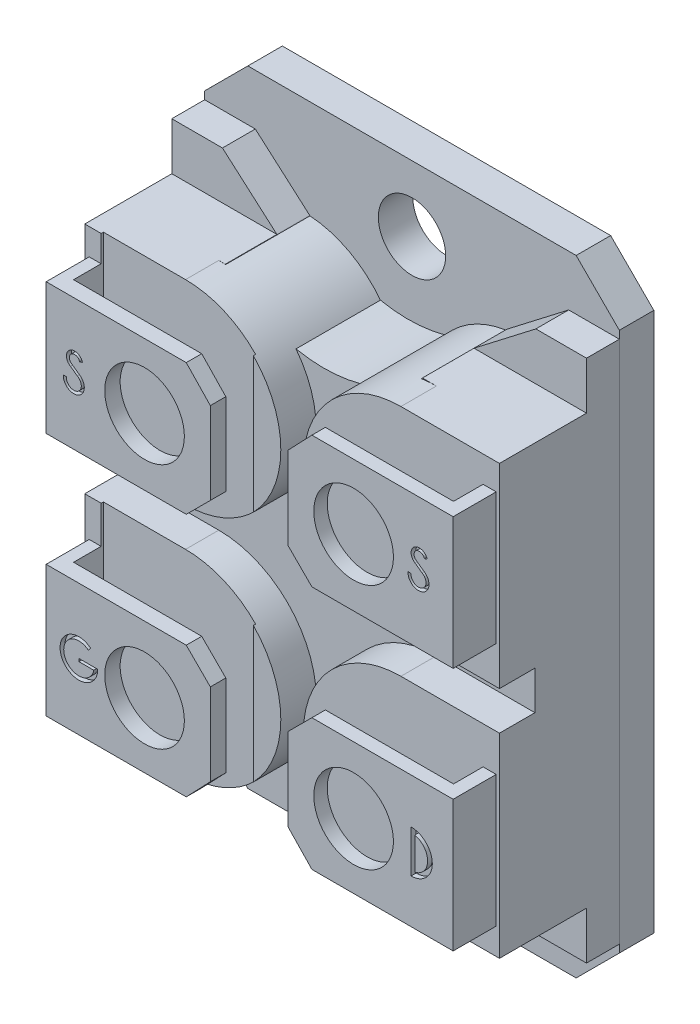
from build123d import *

# Parameters (mm, degrees)
SKETCH1_R           = 2.05
EXTRUDE1_DEPTH      = 2.1
EXTRUDE2_DEPTH      = 7.3
EXTRUDE3_DEPTH      = 5.14
CUT_EXTRUDE1_DEPTH  = 3.14
EXTRUDE4_DEPTH      = 2.62
SKETCH6_W           = 1.8
SKETCH6_H           = 22.9
CUT_EXTRUDE2_DEPTH  = 9.27
SKETCH7_W           = 4.822974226
SKETCH7_H           = 26.361157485
CUT_EXTRUDE4_DEPTH  = 0.2
SKETCH8_W           = 1.815156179
SKETCH8_H           = 27.911127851
CUT_EXTRUDE6_DEPTH  = 9.27
SKETCH9_W           = 2.62
SKETCH9_H           = 24.5
CUT_EXTRUDE7_DEPTH  = 0.27
SKETCH10_R          = 2.425
CUT_EXTRUDE8_DEPTH  = 1
CUT_EXTRUDE9_DEPTH  = 0.3
CUT_EXTRUDE10_DEPTH = 0.3
CUT_EXTRUDE11_DEPTH = 0.3
CUT_EXTRUDE12_DEPTH = 0.3
SKETCH16_W          = 2.1
SKETCH16_H          = 32.84
EXTRUDE5_DEPTH      = 0.0001
SKETCH17_W          = 2.1
SKETCH17_H          = 32.84
EXTRUDE6_DEPTH      = 0.0001


with BuildPart() as part:
    # Sketch1 → Extrude1 (new body)
    with BuildSketch(Plane.XY):
        with BuildLine():
            Line((2.63, 0), (10.575, 0))
            Line((10.575, 0), (10.575, 3.85))
            ThreePointArc((10.575, 3.85), (12.625, 5.9), (14.675, 3.85))
            Line((14.675, 3.85), (14.675, 0))
            Line((14.675, 0), (22.62, 0))
            Line((22.62, 0), (25.250000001, 2.63))
            Line((25.250000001, 2.63), (25.250000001, 35.47))
            Line((25.250000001, 35.47), (22.62, 38.1))
            Line((22.62, 38.1), (2.63, 38.1))
            Line((2.63, 38.1), (-1e-09, 35.47))
            Line((-1e-09, 35.47), (-1e-09, 2.63))
            Line((-1e-09, 2.63), (2.63, 0))
        make_face()
        with Locations((12.625, 34.1)):
            Circle(SKETCH1_R, mode=Mode.SUBTRACT)
    extrude(amount=EXTRUDE1_DEPTH)

    # Sketch2 → Extrude2 (add)
    with BuildSketch(Plane.XY.offset(2.1)):
        with BuildLine():
            Line((-1e-09, 32.1), (-1e-09, 20.225))
            Line((-1e-09, 20.225), (5.999999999, 20.225))
            ThreePointArc((5.999999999, 20.225), (11.937499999, 26.1625), (5.999999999, 32.1))
            Line((5.999999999, 32.1), (-1e-09, 32.1))
        make_face()
        with BuildLine():
            Line((-1e-09, 6), (5.999999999, 6))
            ThreePointArc((5.999999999, 6), (11.937499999, 11.9375), (5.999999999, 17.875))
            Line((5.999999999, 17.875), (-1e-09, 17.875))
            Line((-1e-09, 17.875), (-1e-09, 6))
        make_face()
        with BuildLine():
            Line((25.250000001, 32.1), (19.250000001, 32.1))
            ThreePointArc((19.250000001, 32.1), (13.312500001, 26.1625), (19.250000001, 20.225))
            Line((19.250000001, 20.225), (25.250000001, 20.225))
            Line((25.250000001, 20.225), (25.250000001, 32.1))
        make_face()
        with BuildLine():
            Line((25.250000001, 17.875), (19.250000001, 17.875))
            ThreePointArc((19.250000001, 17.875), (13.312500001, 11.9375), (19.250000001, 6))
            Line((19.250000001, 6), (25.250000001, 6))
            Line((25.250000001, 6), (25.250000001, 17.875))
        make_face()
    extrude(amount=EXTRUDE2_DEPTH)

    # Sketch3 → Extrude3 (add)
    with BuildSketch(Plane.XY.offset(2.1)):
        with BuildLine():
            Line((-1e-09, 35), (3.084073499, 35))
            Line((3.084073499, 35), (6.399999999, 32.1))
            ThreePointArc((6.399999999, 32.1), (12.399999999, 29.614718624), (18.399999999, 32.1))
            Line((18.399999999, 32.1), (22.165926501, 35))
            Line((22.165926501, 35), (25.250000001, 35))
            Line((25.250000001, 35), (25.250000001, 3.1))
            Line((25.250000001, 3.1), (22.165926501, 3.1))
            Line((22.165926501, 3.1), (18.399999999, 6))
            ThreePointArc((18.399999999, 6), (12.399999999, 8.485281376), (6.399999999, 6))
            Line((6.399999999, 6), (3.084073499, 3.1))
            Line((3.084073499, 3.1), (-1e-09, 3.1))
            Line((-1e-09, 3.1), (-1e-09, 35))
        make_face()
    extrude(amount=EXTRUDE3_DEPTH)

    # Sketch4 → Cut-Extrude1 (cut)
    with BuildSketch(Plane.XY.offset(7.24)):
        Polygon((-1e-09, 35), (25.249999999, 35), (25.249999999, 32.1), (0, 32.1), align=None)
        Polygon((25.249999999, 3.1), (25.249999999, 6), (0, 6), (-1e-09, 3.1), align=None)
    extrude(amount=-CUT_EXTRUDE1_DEPTH, mode=Mode.SUBTRACT)

    # Sketch5 → Extrude4 (add)
    with BuildSketch(Plane.XY.offset(9.4)):
        Polygon((-1e-09, 30.5), (8.799999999, 30.5), (10.266640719, 28.96664072), (10.266640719, 23.96664072), (8.799999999, 22.5), (-1e-09, 22.5), align=None)
        Polygon((-1e-09, 7.6), (-1e-09, 15.6), (8.799999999, 15.6), (10.266640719, 14.13335928), (10.266640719, 9.13335928), (8.799999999, 7.6), align=None)
        Polygon((14.983359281, 23.96664072), (16.450000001, 22.5), (25.250000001, 22.5), (25.250000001, 30.5), (16.450000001, 30.5), (14.983359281, 28.96664072), align=None)
        Polygon((14.983359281, 14.13335928), (16.450000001, 15.6), (25.250000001, 15.6), (25.250000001, 7.6), (16.450000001, 7.6), (14.983359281, 9.13335928), align=None)
    extrude(amount=EXTRUDE4_DEPTH)

    # Sketch6 → Cut-Extrude2 (cut)
    with BuildSketch(Plane.ZY.offset(-14.983359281)):
        with Locations((10.3, 19.05)):
            Rectangle(SKETCH6_W, SKETCH6_H)
    extrude(amount=-CUT_EXTRUDE2_DEPTH, mode=Mode.SUBTRACT)

    # Sketch7 → Cut-Extrude4 (cut)
    with BuildSketch(Plane(origin=(25.250000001, 0, 0), x_dir=(0, 0, -1), z_dir=(1, 0, 0))):
        with Locations((-11.811487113, 18.343266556)):
            Rectangle(SKETCH7_W, SKETCH7_H)
    extrude(amount=-CUT_EXTRUDE4_DEPTH, mode=Mode.SUBTRACT)

    # Sketch8 → Cut-Extrude6 (cut)
    with BuildSketch(Plane(origin=(10.266640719, 0, 0), x_dir=(0, 0, -1), z_dir=(1, 0, 0))):
        with Locations((-10.171458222, 18.395068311)):
            Rectangle(SKETCH8_W, SKETCH8_H)
    extrude(amount=-CUT_EXTRUDE6_DEPTH, mode=Mode.SUBTRACT)

    # Sketch9 → Cut-Extrude7 (cut)
    with BuildSketch(Plane.ZY):
        with Locations((10.71, 18.25)):
            Rectangle(SKETCH9_W, SKETCH9_H)
    extrude(amount=-CUT_EXTRUDE7_DEPTH, mode=Mode.SUBTRACT)

    # Sketch10 → Cut-Extrude8 (cut)
    with BuildSketch(Plane.XY.offset(12.02)):
        with Locations((6.26, 26.55)):
            Circle(SKETCH10_R)
        with Locations((18.99, 11.55)):
            Circle(SKETCH10_R)
        with Locations((18.99, 26.55)):
            Circle(SKETCH10_R)
        with Locations((6.26, 11.55)):
            Circle(SKETCH10_R)
    extrude(amount=-CUT_EXTRUDE8_DEPTH, mode=Mode.SUBTRACT)

    # Sketch11 → Cut-Extrude9 (cut)
    with BuildSketch(Plane.XY.offset(12.02)):
        with BuildLine():
            Line((2.321690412, 26.595704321), (1.818877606, 26.951034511))
            ThreePointArc((1.818877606, 26.951034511), (1.818408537, 27.472189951), (2.310128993, 27.299522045))
            Line((2.310128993, 27.299522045), (2.483889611, 27.349186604))
            ThreePointArc((2.483889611, 27.349186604), (1.701389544, 27.610458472), (1.74034141, 26.786412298))
            Line((1.74034141, 26.786412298), (2.169267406, 26.476203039))
            ThreePointArc((2.169267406, 26.476203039), (2.173232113, 25.673393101), (1.496957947, 26.106027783))
            Line((1.496957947, 26.106027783), (1.3152395, 26.118907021))
            ThreePointArc((1.3152395, 26.118907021), (2.226458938, 25.496088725), (2.321690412, 26.595704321))
        make_face()
    extrude(amount=-CUT_EXTRUDE9_DEPTH, mode=Mode.SUBTRACT)

    # Sketch12 → Cut-Extrude10 (cut)
    with BuildSketch(Plane.XY.offset(12.02)):
        with BuildLine():
            Line((23.308968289, 26.710025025), (22.806155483, 27.065355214))
            ThreePointArc((22.806155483, 27.065355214), (22.805686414, 27.586510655), (23.29740687, 27.413842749))
            Line((23.29740687, 27.413842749), (23.471167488, 27.463507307))
            ThreePointArc((23.471167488, 27.463507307), (22.688667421, 27.724779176), (22.727619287, 26.900733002))
            Line((22.727619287, 26.900733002), (23.156545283, 26.590523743))
            ThreePointArc((23.156545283, 26.590523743), (23.16050999, 25.787713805), (22.484235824, 26.220348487))
            Line((22.484235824, 26.220348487), (22.302517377, 26.233227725))
            ThreePointArc((22.302517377, 26.233227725), (23.213736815, 25.610409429), (23.308968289, 26.710025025))
        make_face()
    extrude(amount=-CUT_EXTRUDE10_DEPTH, mode=Mode.SUBTRACT)

    # Sketch14 → Cut-Extrude11 (cut)
    with BuildSketch(Plane.XY.offset(12.02)):
        with BuildLine():
            Line((2.262903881, 11.633273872), (3.410019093, 11.633273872))
            ThreePointArc((3.410019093, 11.633273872), (1.228262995, 11.13790376), (2.982177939, 12.526872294))
            Line((2.982177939, 12.526872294), (2.842249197, 12.353030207))
            ThreePointArc((2.842249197, 12.353030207), (1.396337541, 11.312722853), (3.17118247, 11.463803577))
            Line((3.17118247, 11.463803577), (2.262903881, 11.463803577))
            Line((2.262903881, 11.463803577), (2.262903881, 11.633273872))
        make_face()
    extrude(amount=-CUT_EXTRUDE11_DEPTH, mode=Mode.SUBTRACT)

    # Sketch15 → Cut-Extrude12 (cut)
    with BuildSketch(Plane.XY.offset(12.02)):
        with BuildLine():
            Line((22.490642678, 12.858630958), (22.490642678, 10.275506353))
            ThreePointArc((22.490642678, 10.275506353), (23.782204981, 11.567068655), (22.490642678, 12.858630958))
        make_face()
        with BuildLine():
            Line((22.71873517, 12.547228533), (22.71873517, 10.586908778))
            ThreePointArc((22.71873517, 10.586908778), (23.496992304, 11.567068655), (22.71873517, 12.547228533))
        make_face(mode=Mode.SUBTRACT)
    extrude(amount=-CUT_EXTRUDE12_DEPTH, mode=Mode.SUBTRACT)

    # Sketch16 → Extrude5 (add)
    with BuildSketch(Plane(origin=(25.250000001, 0, 0), x_dir=(0, 0, -1), z_dir=(1, 0, 0))):
        with Locations((-1.05, 19.05)):
            Rectangle(SKETCH16_W, SKETCH16_H)
    extrude(amount=EXTRUDE5_DEPTH)

    # Sketch17 → Extrude6 (add)
    with BuildSketch(Plane.ZY):
        with Locations((1.05, 19.05)):
            Rectangle(SKETCH17_W, SKETCH17_H)
    extrude(amount=EXTRUDE6_DEPTH)


solid = part.part
